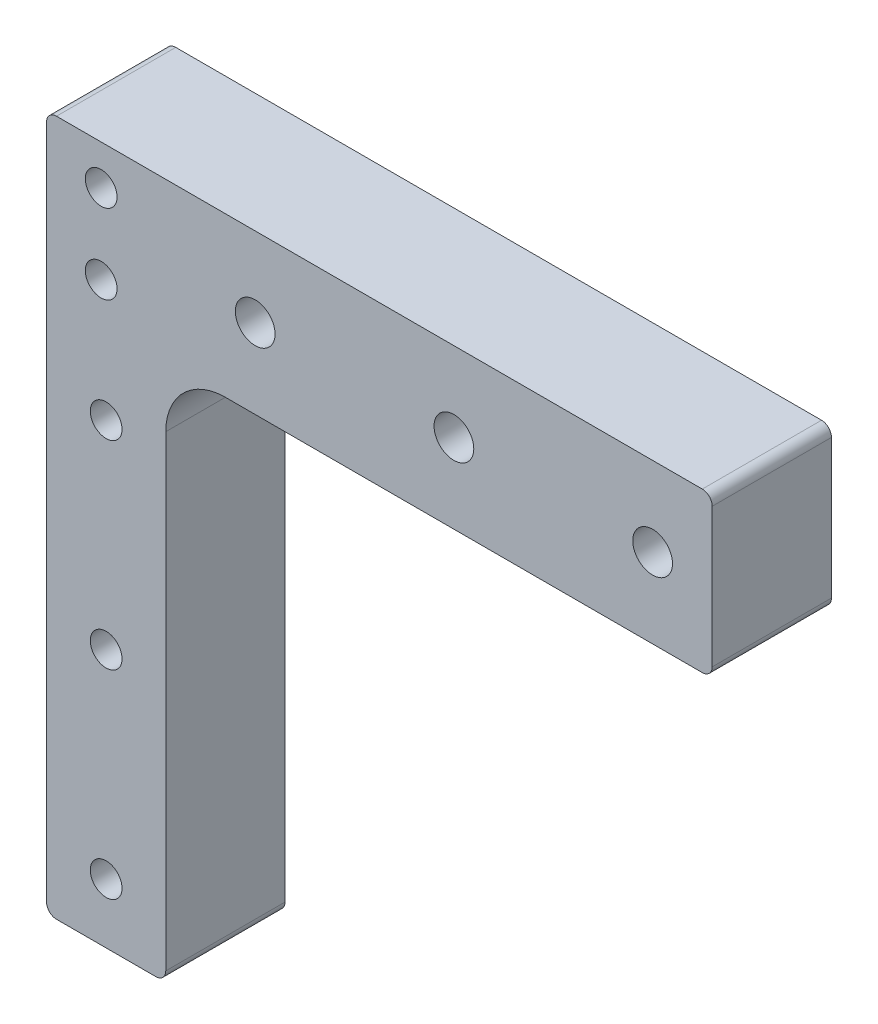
ISO-10303-21;
HEADER;
FILE_DESCRIPTION(('STEP AP214'),'2;1');
FILE_NAME('part.step','',(''),(''),'','','');
FILE_SCHEMA(('AUTOMOTIVE_DESIGN { 1 0 10303 214 1 1 1 1 }'));
ENDSEC;
DATA;
#1=APPLICATION_CONTEXT('core data for automotive mechanical design processes');
#2=APPLICATION_PROTOCOL_DEFINITION('international standard','automotive_design',2000,#1);
#3=PRODUCT_CONTEXT('',#1,'mechanical');
#4=PRODUCT('Part','Part','',(#3));
#5=PRODUCT_RELATED_PRODUCT_CATEGORY('part','',(#4));
#6=PRODUCT_DEFINITION_FORMATION('','',#4);
#7=PRODUCT_DEFINITION_CONTEXT('part definition',#1,'design');
#8=PRODUCT_DEFINITION('design','',#6,#7);
#9=PRODUCT_DEFINITION_SHAPE('','',#8);
#10=(LENGTH_UNIT() NAMED_UNIT(*) SI_UNIT(.MILLI.,.METRE.));
#11=(NAMED_UNIT(*) PLANE_ANGLE_UNIT() SI_UNIT($,.RADIAN.));
#12=(NAMED_UNIT(*) SI_UNIT($,.STERADIAN.) SOLID_ANGLE_UNIT());
#13=UNCERTAINTY_MEASURE_WITH_UNIT(LENGTH_MEASURE(1.E-05),#10,'distance_accuracy_value','');
#14=(GEOMETRIC_REPRESENTATION_CONTEXT(3) GLOBAL_UNCERTAINTY_ASSIGNED_CONTEXT((#13)) GLOBAL_UNIT_ASSIGNED_CONTEXT((#10,
#11,#12)) REPRESENTATION_CONTEXT('',''));
#15=CARTESIAN_POINT('',(0.,0.,0.));
#16=DIRECTION('',(0.,0.,1.));
#17=DIRECTION('',(1.,0.,0.));
#18=AXIS2_PLACEMENT_3D('',#15,#16,#17);
#19=CARTESIAN_POINT('',(0.,0.,12.));
#20=DIRECTION('',(0.,0.,-1.));
#21=DIRECTION('',(-1.,0.,0.));
#22=AXIS2_PLACEMENT_3D('',#19,#20,#21);
#23=CYLINDRICAL_SURFACE('',#22,1.6);
#24=CARTESIAN_POINT('',(0.,0.,7.));
#25=DIRECTION('',(0.,0.,1.));
#26=DIRECTION('',(1.,0.,0.));
#27=AXIS2_PLACEMENT_3D('',#24,#25,#26);
#28=CIRCLE('',#27,1.6);
#29=CARTESIAN_POINT('',(1.6,0.,7.));
#30=VERTEX_POINT('',#29);
#31=EDGE_CURVE('E217',#30,#30,#28,.T.);
#32=ORIENTED_EDGE('',*,*,#31,.T.);
#33=EDGE_LOOP('',(#32));
#34=FACE_BOUND('',#33,.T.);
#35=CARTESIAN_POINT('',(0.,0.,5.));
#36=DIRECTION('',(0.,0.,-1.));
#37=DIRECTION('',(-1.,0.,0.));
#38=AXIS2_PLACEMENT_3D('',#35,#36,#37);
#39=CIRCLE('',#38,1.6);
#40=CARTESIAN_POINT('',(-1.6,0.,5.));
#41=VERTEX_POINT('',#40);
#42=EDGE_CURVE('E45',#41,#41,#39,.T.);
#43=ORIENTED_EDGE('',*,*,#42,.T.);
#44=EDGE_LOOP('',(#43));
#45=FACE_BOUND('',#44,.T.);
#46=ADVANCED_FACE('F41',(#34,#45),#23,.F.);
#47=CARTESIAN_POINT('',(20.,0.,12.));
#48=DIRECTION('',(0.,0.,-1.));
#49=DIRECTION('',(-1.,0.,0.));
#50=AXIS2_PLACEMENT_3D('',#47,#48,#49);
#51=CYLINDRICAL_SURFACE('',#50,1.6);
#52=CARTESIAN_POINT('',(20.,0.,7.));
#53=DIRECTION('',(0.,0.,1.));
#54=DIRECTION('',(1.,0.,0.));
#55=AXIS2_PLACEMENT_3D('',#52,#53,#54);
#56=CIRCLE('',#55,1.6);
#57=CARTESIAN_POINT('',(21.6,0.,7.));
#58=VERTEX_POINT('',#57);
#59=EDGE_CURVE('E213',#58,#58,#56,.T.);
#60=ORIENTED_EDGE('',*,*,#59,.T.);
#61=EDGE_LOOP('',(#60));
#62=FACE_BOUND('',#61,.T.);
#63=CARTESIAN_POINT('',(20.,0.,5.));
#64=DIRECTION('',(0.,0.,-1.));
#65=DIRECTION('',(-1.,0.,0.));
#66=AXIS2_PLACEMENT_3D('',#63,#64,#65);
#67=CIRCLE('',#66,1.6);
#68=CARTESIAN_POINT('',(18.4,0.,5.));
#69=VERTEX_POINT('',#68);
#70=EDGE_CURVE('E223',#69,#69,#67,.T.);
#71=ORIENTED_EDGE('',*,*,#70,.T.);
#72=EDGE_LOOP('',(#71));
#73=FACE_BOUND('',#72,.T.);
#74=ADVANCED_FACE('F335',(#62,#73),#51,.F.);
#75=CARTESIAN_POINT('',(40.,0.,12.));
#76=DIRECTION('',(0.,0.,-1.));
#77=DIRECTION('',(-1.,0.,0.));
#78=AXIS2_PLACEMENT_3D('',#75,#76,#77);
#79=CYLINDRICAL_SURFACE('',#78,1.6);
#80=CARTESIAN_POINT('',(40.,0.,7.));
#81=DIRECTION('',(0.,0.,1.));
#82=DIRECTION('',(1.,0.,0.));
#83=AXIS2_PLACEMENT_3D('',#80,#81,#82);
#84=CIRCLE('',#83,1.6);
#85=CARTESIAN_POINT('',(41.6,0.,7.));
#86=VERTEX_POINT('',#85);
#87=EDGE_CURVE('E210',#86,#86,#84,.T.);
#88=ORIENTED_EDGE('',*,*,#87,.T.);
#89=EDGE_LOOP('',(#88));
#90=FACE_BOUND('',#89,.T.);
#91=CARTESIAN_POINT('',(40.,0.,5.));
#92=DIRECTION('',(0.,0.,-1.));
#93=DIRECTION('',(-1.,0.,0.));
#94=AXIS2_PLACEMENT_3D('',#91,#92,#93);
#95=CIRCLE('',#94,1.6);
#96=CARTESIAN_POINT('',(38.4,0.,5.));
#97=VERTEX_POINT('',#96);
#98=EDGE_CURVE('E221',#97,#97,#95,.T.);
#99=ORIENTED_EDGE('',*,*,#98,.T.);
#100=EDGE_LOOP('',(#99));
#101=FACE_BOUND('',#100,.T.);
#102=ADVANCED_FACE('F342',(#90,#101),#79,.F.);
#103=CARTESIAN_POINT('',(0.,0.,12.));
#104=DIRECTION('',(0.,0.,1.));
#105=DIRECTION('',(1.,0.,0.));
#106=AXIS2_PLACEMENT_3D('',#103,#104,#105);
#107=PLANE('',#106);
#108=CARTESIAN_POINT('',(0.,0.,12.));
#109=DIRECTION('',(0.,0.,1.));
#110=DIRECTION('',(1.,0.,0.));
#111=AXIS2_PLACEMENT_3D('',#108,#109,#110);
#112=CIRCLE('',#111,2.);
#113=CARTESIAN_POINT('',(2.,0.,12.));
#114=VERTEX_POINT('',#113);
#115=EDGE_CURVE('E683',#114,#114,#112,.T.);
#116=ORIENTED_EDGE('',*,*,#115,.F.);
#117=EDGE_LOOP('',(#116));
#118=FACE_BOUND('',#117,.T.);
#119=CARTESIAN_POINT('',(20.,0.,12.));
#120=DIRECTION('',(0.,0.,1.));
#121=DIRECTION('',(1.,0.,0.));
#122=AXIS2_PLACEMENT_3D('',#119,#120,#121);
#123=CIRCLE('',#122,2.);
#124=CARTESIAN_POINT('',(22.,0.,12.));
#125=VERTEX_POINT('',#124);
#126=EDGE_CURVE('E686',#125,#125,#123,.T.);
#127=ORIENTED_EDGE('',*,*,#126,.F.);
#128=EDGE_LOOP('',(#127));
#129=FACE_BOUND('',#128,.T.);
#130=CARTESIAN_POINT('',(40.,0.,12.));
#131=DIRECTION('',(0.,0.,1.));
#132=DIRECTION('',(1.,0.,0.));
#133=AXIS2_PLACEMENT_3D('',#130,#131,#132);
#134=CIRCLE('',#133,2.);
#135=CARTESIAN_POINT('',(42.,0.,12.));
#136=VERTEX_POINT('',#135);
#137=EDGE_CURVE('E233',#136,#136,#134,.T.);
#138=ORIENTED_EDGE('',*,*,#137,.F.);
#139=EDGE_LOOP('',(#138));
#140=FACE_BOUND('',#139,.T.);
#141=CARTESIAN_POINT('',(-15.0000000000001,-36.,12.));
#142=DIRECTION('',(0.,0.,1.));
#143=DIRECTION('',(1.,0.,0.));
#144=AXIS2_PLACEMENT_3D('',#141,#142,#143);
#145=CIRCLE('',#144,1.6);
#146=CARTESIAN_POINT('',(-13.4000000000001,-36.,12.));
#147=VERTEX_POINT('',#146);
#148=EDGE_CURVE('E248',#147,#147,#145,.T.);
#149=ORIENTED_EDGE('',*,*,#148,.F.);
#150=EDGE_LOOP('',(#149));
#151=FACE_BOUND('',#150,.T.);
#152=CARTESIAN_POINT('',(-15.5,-4.00000000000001,12.));
#153=DIRECTION('',(0.,0.,1.));
#154=DIRECTION('',(1.,0.,0.));
#155=AXIS2_PLACEMENT_3D('',#152,#153,#154);
#156=CIRCLE('',#155,1.6);
#157=CARTESIAN_POINT('',(-13.9,-4.00000000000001,12.));
#158=VERTEX_POINT('',#157);
#159=EDGE_CURVE('E260',#158,#158,#156,.T.);
#160=ORIENTED_EDGE('',*,*,#159,.F.);
#161=EDGE_LOOP('',(#160));
#162=FACE_BOUND('',#161,.T.);
#163=DIRECTION('',(1.,0.,0.));
#164=VECTOR('',#163,1.);
#165=CARTESIAN_POINT('',(-9.,-8.,12.));
#166=LINE('',#165,#164);
#167=CARTESIAN_POINT('',(-3.,-8.,12.));
#168=VERTEX_POINT('',#167);
#169=CARTESIAN_POINT('',(45.,-8.,12.));
#170=VERTEX_POINT('',#169);
#171=EDGE_CURVE('E154',#168,#170,#166,.T.);
#172=ORIENTED_EDGE('',*,*,#171,.T.);
#173=CARTESIAN_POINT('',(45.,-7.,12.));
#174=DIRECTION('',(0.,0.,1.));
#175=DIRECTION('',(1.,0.,0.));
#176=AXIS2_PLACEMENT_3D('',#173,#174,#175);
#177=CIRCLE('',#176,1.);
#178=CARTESIAN_POINT('',(46.,-7.,12.));
#179=VERTEX_POINT('',#178);
#180=EDGE_CURVE('E195',#170,#179,#177,.T.);
#181=ORIENTED_EDGE('',*,*,#180,.T.);
#182=DIRECTION('',(0.,1.,0.));
#183=VECTOR('',#182,1.);
#184=CARTESIAN_POINT('',(46.,8.,12.));
#185=LINE('',#184,#183);
#186=CARTESIAN_POINT('',(46.,7.,12.));
#187=VERTEX_POINT('',#186);
#188=EDGE_CURVE('E160',#179,#187,#185,.T.);
#189=ORIENTED_EDGE('',*,*,#188,.T.);
#190=CARTESIAN_POINT('',(45.,7.,12.));
#191=DIRECTION('',(0.,0.,1.));
#192=DIRECTION('',(1.,0.,0.));
#193=AXIS2_PLACEMENT_3D('',#190,#191,#192);
#194=CIRCLE('',#193,1.);
#195=CARTESIAN_POINT('',(45.,8.,12.));
#196=VERTEX_POINT('',#195);
#197=EDGE_CURVE('E193',#187,#196,#194,.T.);
#198=ORIENTED_EDGE('',*,*,#197,.T.);
#199=DIRECTION('',(-1.,0.,0.));
#200=VECTOR('',#199,1.);
#201=CARTESIAN_POINT('',(46.,8.,12.));
#202=LINE('',#201,#200);
#203=CARTESIAN_POINT('',(-20.,7.99999999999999,12.));
#204=VERTEX_POINT('',#203);
#205=EDGE_CURVE('E164',#196,#204,#202,.T.);
#206=ORIENTED_EDGE('',*,*,#205,.T.);
#207=CARTESIAN_POINT('',(-20.,6.99999999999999,12.));
#208=DIRECTION('',(0.,0.,1.));
#209=DIRECTION('',(1.,0.,0.));
#210=AXIS2_PLACEMENT_3D('',#207,#208,#209);
#211=CIRCLE('',#210,1.);
#212=CARTESIAN_POINT('',(-21.,6.99999999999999,12.));
#213=VERTEX_POINT('',#212);
#214=EDGE_CURVE('E188',#204,#213,#211,.T.);
#215=ORIENTED_EDGE('',*,*,#214,.T.);
#216=DIRECTION('',(0.,-1.,0.));
#217=VECTOR('',#216,1.);
#218=CARTESIAN_POINT('',(-21.,7.99999999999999,12.));
#219=LINE('',#218,#217);
#220=CARTESIAN_POINT('',(-21.,-61.,12.));
#221=VERTEX_POINT('',#220);
#222=EDGE_CURVE('E274',#213,#221,#219,.T.);
#223=ORIENTED_EDGE('',*,*,#222,.T.);
#224=CARTESIAN_POINT('',(-20.,-61.,12.));
#225=DIRECTION('',(0.,0.,1.));
#226=DIRECTION('',(1.,0.,0.));
#227=AXIS2_PLACEMENT_3D('',#224,#225,#226);
#228=CIRCLE('',#227,1.);
#229=CARTESIAN_POINT('',(-20.,-62.,12.));
#230=VERTEX_POINT('',#229);
#231=EDGE_CURVE('E191',#221,#230,#228,.T.);
#232=ORIENTED_EDGE('',*,*,#231,.T.);
#233=DIRECTION('',(1.,0.,0.));
#234=VECTOR('',#233,1.);
#235=CARTESIAN_POINT('',(-21.,-62.,12.));
#236=LINE('',#235,#234);
#237=CARTESIAN_POINT('',(-10.,-62.,12.));
#238=VERTEX_POINT('',#237);
#239=EDGE_CURVE('E277',#230,#238,#236,.T.);
#240=ORIENTED_EDGE('',*,*,#239,.T.);
#241=CARTESIAN_POINT('',(-10.,-61.,12.));
#242=DIRECTION('',(0.,0.,1.));
#243=DIRECTION('',(1.,0.,0.));
#244=AXIS2_PLACEMENT_3D('',#241,#242,#243);
#245=CIRCLE('',#244,1.);
#246=CARTESIAN_POINT('',(-9.,-61.,12.));
#247=VERTEX_POINT('',#246);
#248=EDGE_CURVE('E58',#238,#247,#245,.T.);
#249=ORIENTED_EDGE('',*,*,#248,.T.);
#250=DIRECTION('',(0.,1.,0.));
#251=VECTOR('',#250,1.);
#252=CARTESIAN_POINT('',(-9.,-62.,12.));
#253=LINE('',#252,#251);
#254=CARTESIAN_POINT('',(-9.,-14.,12.));
#255=VERTEX_POINT('',#254);
#256=EDGE_CURVE('E279',#247,#255,#253,.T.);
#257=ORIENTED_EDGE('',*,*,#256,.T.);
#258=CARTESIAN_POINT('',(-3.,-14.,12.));
#259=DIRECTION('',(0.,0.,1.));
#260=DIRECTION('',(1.,0.,0.));
#261=AXIS2_PLACEMENT_3D('',#258,#259,#260);
#262=CIRCLE('',#261,6.);
#263=EDGE_CURVE('E145',#255,#168,#262,.F.);
#264=ORIENTED_EDGE('',*,*,#263,.T.);
#265=EDGE_LOOP('',(#172,#181,#189,#198,#206,#215,#223,#232,#240,#249,#257,#264));
#266=FACE_BOUND('',#265,.T.);
#267=CARTESIAN_POINT('',(-15.5,3.99999999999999,12.));
#268=DIRECTION('',(0.,0.,1.));
#269=DIRECTION('',(1.,0.,0.));
#270=AXIS2_PLACEMENT_3D('',#267,#268,#269);
#271=CIRCLE('',#270,1.6);
#272=CARTESIAN_POINT('',(-13.9,3.99999999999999,12.));
#273=VERTEX_POINT('',#272);
#274=EDGE_CURVE('E266',#273,#273,#271,.T.);
#275=ORIENTED_EDGE('',*,*,#274,.F.);
#276=EDGE_LOOP('',(#275));
#277=FACE_BOUND('',#276,.T.);
#278=CARTESIAN_POINT('',(-15.,-56.,12.));
#279=DIRECTION('',(0.,0.,1.));
#280=DIRECTION('',(1.,0.,0.));
#281=AXIS2_PLACEMENT_3D('',#278,#279,#280);
#282=CIRCLE('',#281,1.6);
#283=CARTESIAN_POINT('',(-13.4,-56.,12.));
#284=VERTEX_POINT('',#283);
#285=EDGE_CURVE('E254',#284,#284,#282,.T.);
#286=ORIENTED_EDGE('',*,*,#285,.F.);
#287=EDGE_LOOP('',(#286));
#288=FACE_BOUND('',#287,.T.);
#289=CARTESIAN_POINT('',(-15.0000000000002,-16.,12.));
#290=DIRECTION('',(0.,0.,1.));
#291=DIRECTION('',(1.,0.,0.));
#292=AXIS2_PLACEMENT_3D('',#289,#290,#291);
#293=CIRCLE('',#292,1.6);
#294=CARTESIAN_POINT('',(-13.4000000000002,-16.,12.));
#295=VERTEX_POINT('',#294);
#296=EDGE_CURVE('E242',#295,#295,#293,.T.);
#297=ORIENTED_EDGE('',*,*,#296,.F.);
#298=EDGE_LOOP('',(#297));
#299=FACE_BOUND('',#298,.T.);
#300=ADVANCED_FACE('F297',(#118,#129,#140,#151,#162,#266,#277,#288,#299),#107,.T.);
#301=CARTESIAN_POINT('',(0.,0.,0.));
#302=DIRECTION('',(0.,0.,1.));
#303=DIRECTION('',(1.,0.,0.));
#304=AXIS2_PLACEMENT_3D('',#301,#302,#303);
#305=PLANE('',#304);
#306=CARTESIAN_POINT('',(0.,0.,0.));
#307=DIRECTION('',(0.,0.,-1.));
#308=DIRECTION('',(-1.,0.,0.));
#309=AXIS2_PLACEMENT_3D('',#306,#307,#308);
#310=CIRCLE('',#309,2.);
#311=CARTESIAN_POINT('',(-2.,0.,0.));
#312=VERTEX_POINT('',#311);
#313=EDGE_CURVE('E664',#312,#312,#310,.T.);
#314=ORIENTED_EDGE('',*,*,#313,.F.);
#315=EDGE_LOOP('',(#314));
#316=FACE_BOUND('',#315,.T.);
#317=CARTESIAN_POINT('',(20.,-1.39659253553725E-13,0.));
#318=DIRECTION('',(0.,0.,-1.));
#319=DIRECTION('',(-1.,0.,0.));
#320=AXIS2_PLACEMENT_3D('',#317,#318,#319);
#321=CIRCLE('',#320,2.);
#322=CARTESIAN_POINT('',(18.,-1.39659253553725E-13,0.));
#323=VERTEX_POINT('',#322);
#324=EDGE_CURVE('E667',#323,#323,#321,.T.);
#325=ORIENTED_EDGE('',*,*,#324,.F.);
#326=EDGE_LOOP('',(#325));
#327=FACE_BOUND('',#326,.T.);
#328=CARTESIAN_POINT('',(40.,-2.79318507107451E-13,0.));
#329=DIRECTION('',(0.,0.,-1.));
#330=DIRECTION('',(-1.,0.,0.));
#331=AXIS2_PLACEMENT_3D('',#328,#329,#330);
#332=CIRCLE('',#331,2.);
#333=CARTESIAN_POINT('',(38.,-2.79318507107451E-13,0.));
#334=VERTEX_POINT('',#333);
#335=EDGE_CURVE('E675',#334,#334,#332,.T.);
#336=ORIENTED_EDGE('',*,*,#335,.F.);
#337=EDGE_LOOP('',(#336));
#338=FACE_BOUND('',#337,.T.);
#339=DIRECTION('',(0.,1.,0.));
#340=VECTOR('',#339,1.);
#341=CARTESIAN_POINT('',(46.,8.,0.));
#342=LINE('',#341,#340);
#343=CARTESIAN_POINT('',(46.,-7.,0.));
#344=VERTEX_POINT('',#343);
#345=CARTESIAN_POINT('',(46.,7.,0.));
#346=VERTEX_POINT('',#345);
#347=EDGE_CURVE('E269',#344,#346,#342,.T.);
#348=ORIENTED_EDGE('',*,*,#347,.F.);
#349=CARTESIAN_POINT('',(45.,-7.,0.));
#350=DIRECTION('',(0.,0.,1.));
#351=DIRECTION('',(1.,0.,0.));
#352=AXIS2_PLACEMENT_3D('',#349,#350,#351);
#353=CIRCLE('',#352,1.);
#354=CARTESIAN_POINT('',(45.,-8.,0.));
#355=VERTEX_POINT('',#354);
#356=EDGE_CURVE('E159',#344,#355,#353,.F.);
#357=ORIENTED_EDGE('',*,*,#356,.T.);
#358=DIRECTION('',(1.,0.,0.));
#359=VECTOR('',#358,1.);
#360=CARTESIAN_POINT('',(-9.,-8.,0.));
#361=LINE('',#360,#359);
#362=CARTESIAN_POINT('',(-3.,-8.,0.));
#363=VERTEX_POINT('',#362);
#364=EDGE_CURVE('E151',#363,#355,#361,.T.);
#365=ORIENTED_EDGE('',*,*,#364,.F.);
#366=CARTESIAN_POINT('',(-3.,-14.,0.));
#367=DIRECTION('',(0.,0.,1.));
#368=DIRECTION('',(1.,0.,0.));
#369=AXIS2_PLACEMENT_3D('',#366,#367,#368);
#370=CIRCLE('',#369,6.);
#371=CARTESIAN_POINT('',(-9.,-14.,0.));
#372=VERTEX_POINT('',#371);
#373=EDGE_CURVE('E135',#363,#372,#370,.T.);
#374=ORIENTED_EDGE('',*,*,#373,.T.);
#375=DIRECTION('',(0.,1.,0.));
#376=VECTOR('',#375,1.);
#377=CARTESIAN_POINT('',(-9.,-62.,0.));
#378=LINE('',#377,#376);
#379=CARTESIAN_POINT('',(-9.,-61.,0.));
#380=VERTEX_POINT('',#379);
#381=EDGE_CURVE('E161',#380,#372,#378,.T.);
#382=ORIENTED_EDGE('',*,*,#381,.F.);
#383=CARTESIAN_POINT('',(-10.,-61.,0.));
#384=DIRECTION('',(0.,0.,1.));
#385=DIRECTION('',(1.,0.,0.));
#386=AXIS2_PLACEMENT_3D('',#383,#384,#385);
#387=CIRCLE('',#386,1.);
#388=CARTESIAN_POINT('',(-10.,-62.,0.));
#389=VERTEX_POINT('',#388);
#390=EDGE_CURVE('E179',#380,#389,#387,.F.);
#391=ORIENTED_EDGE('',*,*,#390,.T.);
#392=DIRECTION('',(1.,0.,0.));
#393=VECTOR('',#392,1.);
#394=CARTESIAN_POINT('',(-21.,-62.,0.));
#395=LINE('',#394,#393);
#396=CARTESIAN_POINT('',(-20.,-62.,0.));
#397=VERTEX_POINT('',#396);
#398=EDGE_CURVE('E166',#397,#389,#395,.T.);
#399=ORIENTED_EDGE('',*,*,#398,.F.);
#400=CARTESIAN_POINT('',(-20.,-61.,0.));
#401=DIRECTION('',(0.,0.,1.));
#402=DIRECTION('',(1.,0.,0.));
#403=AXIS2_PLACEMENT_3D('',#400,#401,#402);
#404=CIRCLE('',#403,1.);
#405=CARTESIAN_POINT('',(-21.,-61.,0.));
#406=VERTEX_POINT('',#405);
#407=EDGE_CURVE('E181',#397,#406,#404,.F.);
#408=ORIENTED_EDGE('',*,*,#407,.T.);
#409=DIRECTION('',(0.,-1.,0.));
#410=VECTOR('',#409,1.);
#411=CARTESIAN_POINT('',(-21.,7.99999999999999,0.));
#412=LINE('',#411,#410);
#413=CARTESIAN_POINT('',(-21.,6.99999999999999,0.));
#414=VERTEX_POINT('',#413);
#415=EDGE_CURVE('E287',#414,#406,#412,.T.);
#416=ORIENTED_EDGE('',*,*,#415,.F.);
#417=CARTESIAN_POINT('',(-20.,6.99999999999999,0.));
#418=DIRECTION('',(0.,0.,1.));
#419=DIRECTION('',(1.,0.,0.));
#420=AXIS2_PLACEMENT_3D('',#417,#418,#419);
#421=CIRCLE('',#420,1.);
#422=CARTESIAN_POINT('',(-20.,7.99999999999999,0.));
#423=VERTEX_POINT('',#422);
#424=EDGE_CURVE('E177',#414,#423,#421,.F.);
#425=ORIENTED_EDGE('',*,*,#424,.T.);
#426=DIRECTION('',(-1.,0.,0.));
#427=VECTOR('',#426,1.);
#428=CARTESIAN_POINT('',(46.,8.,0.));
#429=LINE('',#428,#427);
#430=CARTESIAN_POINT('',(45.,8.,0.));
#431=VERTEX_POINT('',#430);
#432=EDGE_CURVE('E284',#431,#423,#429,.T.);
#433=ORIENTED_EDGE('',*,*,#432,.F.);
#434=CARTESIAN_POINT('',(45.,7.,0.));
#435=DIRECTION('',(0.,0.,1.));
#436=DIRECTION('',(1.,0.,0.));
#437=AXIS2_PLACEMENT_3D('',#434,#435,#436);
#438=CIRCLE('',#437,1.);
#439=EDGE_CURVE('E183',#431,#346,#438,.F.);
#440=ORIENTED_EDGE('',*,*,#439,.T.);
#441=EDGE_LOOP('',(#348,#357,#365,#374,#382,#391,#399,#408,#416,#425,#433,#440));
#442=FACE_BOUND('',#441,.T.);
#443=CARTESIAN_POINT('',(-15.5,3.99999999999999,0.));
#444=DIRECTION('',(0.,0.,1.));
#445=DIRECTION('',(1.,0.,0.));
#446=AXIS2_PLACEMENT_3D('',#443,#444,#445);
#447=CIRCLE('',#446,1.6);
#448=CARTESIAN_POINT('',(-13.9,3.99999999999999,0.));
#449=VERTEX_POINT('',#448);
#450=EDGE_CURVE('E263',#449,#449,#447,.T.);
#451=ORIENTED_EDGE('',*,*,#450,.T.);
#452=EDGE_LOOP('',(#451));
#453=FACE_BOUND('',#452,.T.);
#454=CARTESIAN_POINT('',(-15.5,-4.00000000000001,0.));
#455=DIRECTION('',(0.,0.,1.));
#456=DIRECTION('',(1.,0.,0.));
#457=AXIS2_PLACEMENT_3D('',#454,#455,#456);
#458=CIRCLE('',#457,1.6);
#459=CARTESIAN_POINT('',(-13.9,-4.00000000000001,0.));
#460=VERTEX_POINT('',#459);
#461=EDGE_CURVE('E257',#460,#460,#458,.T.);
#462=ORIENTED_EDGE('',*,*,#461,.T.);
#463=EDGE_LOOP('',(#462));
#464=FACE_BOUND('',#463,.T.);
#465=CARTESIAN_POINT('',(-15.,-56.,0.));
#466=DIRECTION('',(0.,0.,1.));
#467=DIRECTION('',(1.,0.,0.));
#468=AXIS2_PLACEMENT_3D('',#465,#466,#467);
#469=CIRCLE('',#468,1.6);
#470=CARTESIAN_POINT('',(-13.4,-56.,0.));
#471=VERTEX_POINT('',#470);
#472=EDGE_CURVE('E251',#471,#471,#469,.T.);
#473=ORIENTED_EDGE('',*,*,#472,.T.);
#474=EDGE_LOOP('',(#473));
#475=FACE_BOUND('',#474,.T.);
#476=CARTESIAN_POINT('',(-15.0000000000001,-36.,0.));
#477=DIRECTION('',(0.,0.,1.));
#478=DIRECTION('',(1.,0.,0.));
#479=AXIS2_PLACEMENT_3D('',#476,#477,#478);
#480=CIRCLE('',#479,1.6);
#481=CARTESIAN_POINT('',(-13.4000000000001,-36.,0.));
#482=VERTEX_POINT('',#481);
#483=EDGE_CURVE('E245',#482,#482,#480,.T.);
#484=ORIENTED_EDGE('',*,*,#483,.T.);
#485=EDGE_LOOP('',(#484));
#486=FACE_BOUND('',#485,.T.);
#487=CARTESIAN_POINT('',(-15.0000000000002,-16.,0.));
#488=DIRECTION('',(0.,0.,1.));
#489=DIRECTION('',(1.,0.,0.));
#490=AXIS2_PLACEMENT_3D('',#487,#488,#489);
#491=CIRCLE('',#490,1.6);
#492=CARTESIAN_POINT('',(-13.4000000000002,-16.,0.));
#493=VERTEX_POINT('',#492);
#494=EDGE_CURVE('E220',#493,#493,#491,.T.);
#495=ORIENTED_EDGE('',*,*,#494,.T.);
#496=EDGE_LOOP('',(#495));
#497=FACE_BOUND('',#496,.T.);
#498=ADVANCED_FACE('F157',(#316,#327,#338,#442,#453,#464,#475,#486,#497),#305,.F.);
#499=CARTESIAN_POINT('',(46.,8.,12.));
#500=DIRECTION('',(-1.,0.,0.));
#501=DIRECTION('',(0.,0.,1.));
#502=AXIS2_PLACEMENT_3D('',#499,#500,#501);
#503=PLANE('',#502);
#504=ORIENTED_EDGE('',*,*,#188,.F.);
#505=DIRECTION('',(0.,0.,-1.));
#506=VECTOR('',#505,1.);
#507=CARTESIAN_POINT('',(46.,-7.,12.));
#508=LINE('',#507,#506);
#509=EDGE_CURVE('E174',#179,#344,#508,.T.);
#510=ORIENTED_EDGE('',*,*,#509,.T.);
#511=ORIENTED_EDGE('',*,*,#347,.T.);
#512=DIRECTION('',(0.,0.,-1.));
#513=VECTOR('',#512,1.);
#514=CARTESIAN_POINT('',(46.,7.,12.));
#515=LINE('',#514,#513);
#516=EDGE_CURVE('E172',#346,#187,#515,.F.);
#517=ORIENTED_EDGE('',*,*,#516,.T.);
#518=EDGE_LOOP('',(#504,#510,#511,#517));
#519=FACE_BOUND('',#518,.T.);
#520=ADVANCED_FACE('F305',(#519),#503,.F.);
#521=CARTESIAN_POINT('',(46.,8.,12.));
#522=DIRECTION('',(0.,-1.,0.));
#523=DIRECTION('',(1.,0.,0.));
#524=AXIS2_PLACEMENT_3D('',#521,#522,#523);
#525=PLANE('',#524);
#526=ORIENTED_EDGE('',*,*,#205,.F.);
#527=DIRECTION('',(0.,0.,-1.));
#528=VECTOR('',#527,1.);
#529=CARTESIAN_POINT('',(45.,8.,12.));
#530=LINE('',#529,#528);
#531=EDGE_CURVE('E199',#196,#431,#530,.T.);
#532=ORIENTED_EDGE('',*,*,#531,.T.);
#533=ORIENTED_EDGE('',*,*,#432,.T.);
#534=DIRECTION('',(0.,0.,-1.));
#535=VECTOR('',#534,1.);
#536=CARTESIAN_POINT('',(-20.,7.99999999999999,12.));
#537=LINE('',#536,#535);
#538=EDGE_CURVE('E197',#423,#204,#537,.F.);
#539=ORIENTED_EDGE('',*,*,#538,.T.);
#540=EDGE_LOOP('',(#526,#532,#533,#539));
#541=FACE_BOUND('',#540,.T.);
#542=ADVANCED_FACE('F314',(#541),#525,.F.);
#543=CARTESIAN_POINT('',(-21.,7.99999999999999,12.));
#544=DIRECTION('',(1.,0.,0.));
#545=DIRECTION('',(0.,1.,0.));
#546=AXIS2_PLACEMENT_3D('',#543,#544,#545);
#547=PLANE('',#546);
#548=ORIENTED_EDGE('',*,*,#415,.T.);
#549=DIRECTION('',(0.,0.,-1.));
#550=VECTOR('',#549,1.);
#551=CARTESIAN_POINT('',(-21.,-61.,12.));
#552=LINE('',#551,#550);
#553=EDGE_CURVE('E50',#406,#221,#552,.F.);
#554=ORIENTED_EDGE('',*,*,#553,.T.);
#555=ORIENTED_EDGE('',*,*,#222,.F.);
#556=DIRECTION('',(0.,0.,-1.));
#557=VECTOR('',#556,1.);
#558=CARTESIAN_POINT('',(-21.,6.99999999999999,12.));
#559=LINE('',#558,#557);
#560=EDGE_CURVE('E206',#213,#414,#559,.T.);
#561=ORIENTED_EDGE('',*,*,#560,.T.);
#562=EDGE_LOOP('',(#548,#554,#555,#561));
#563=FACE_BOUND('',#562,.T.);
#564=ADVANCED_FACE('F322',(#563),#547,.F.);
#565=CARTESIAN_POINT('',(-21.,-62.,12.));
#566=DIRECTION('',(0.,1.,0.));
#567=DIRECTION('',(0.,0.,1.));
#568=AXIS2_PLACEMENT_3D('',#565,#566,#567);
#569=PLANE('',#568);
#570=ORIENTED_EDGE('',*,*,#239,.F.);
#571=DIRECTION('',(0.,0.,-1.));
#572=VECTOR('',#571,1.);
#573=CARTESIAN_POINT('',(-20.,-62.,12.));
#574=LINE('',#573,#572);
#575=EDGE_CURVE('E203',#230,#397,#574,.T.);
#576=ORIENTED_EDGE('',*,*,#575,.T.);
#577=ORIENTED_EDGE('',*,*,#398,.T.);
#578=DIRECTION('',(0.,0.,-1.));
#579=VECTOR('',#578,1.);
#580=CARTESIAN_POINT('',(-10.,-62.,12.));
#581=LINE('',#580,#579);
#582=EDGE_CURVE('E66',#389,#238,#581,.F.);
#583=ORIENTED_EDGE('',*,*,#582,.T.);
#584=EDGE_LOOP('',(#570,#576,#577,#583));
#585=FACE_BOUND('',#584,.T.);
#586=ADVANCED_FACE('F290',(#585),#569,.F.);
#587=CARTESIAN_POINT('',(-9.,-62.,12.));
#588=DIRECTION('',(-1.,0.,0.));
#589=DIRECTION('',(0.,0.,1.));
#590=AXIS2_PLACEMENT_3D('',#587,#588,#589);
#591=PLANE('',#590);
#592=ORIENTED_EDGE('',*,*,#256,.F.);
#593=DIRECTION('',(0.,0.,-1.));
#594=VECTOR('',#593,1.);
#595=CARTESIAN_POINT('',(-9.,-61.,12.));
#596=LINE('',#595,#594);
#597=EDGE_CURVE('E11',#247,#380,#596,.T.);
#598=ORIENTED_EDGE('',*,*,#597,.T.);
#599=ORIENTED_EDGE('',*,*,#381,.T.);
#600=DIRECTION('',(0.,0.,-1.));
#601=VECTOR('',#600,1.);
#602=CARTESIAN_POINT('',(-9.,-14.,12.));
#603=LINE('',#602,#601);
#604=EDGE_CURVE('E141',#372,#255,#603,.F.);
#605=ORIENTED_EDGE('',*,*,#604,.T.);
#606=EDGE_LOOP('',(#592,#598,#599,#605));
#607=FACE_BOUND('',#606,.T.);
#608=ADVANCED_FACE('F296',(#607),#591,.F.);
#609=CARTESIAN_POINT('',(-9.,-8.,12.));
#610=DIRECTION('',(0.,1.,0.));
#611=DIRECTION('',(0.,0.,1.));
#612=AXIS2_PLACEMENT_3D('',#609,#610,#611);
#613=PLANE('',#612);
#614=ORIENTED_EDGE('',*,*,#364,.T.);
#615=DIRECTION('',(0.,0.,-1.));
#616=VECTOR('',#615,1.);
#617=CARTESIAN_POINT('',(45.,-8.,12.));
#618=LINE('',#617,#616);
#619=EDGE_CURVE('E186',#355,#170,#618,.F.);
#620=ORIENTED_EDGE('',*,*,#619,.T.);
#621=ORIENTED_EDGE('',*,*,#171,.F.);
#622=DIRECTION('',(0.,0.,-1.));
#623=VECTOR('',#622,1.);
#624=CARTESIAN_POINT('',(-3.,-8.,0.));
#625=LINE('',#624,#623);
#626=EDGE_CURVE('E139',#168,#363,#625,.T.);
#627=ORIENTED_EDGE('',*,*,#626,.T.);
#628=EDGE_LOOP('',(#614,#620,#621,#627));
#629=FACE_BOUND('',#628,.T.);
#630=ADVANCED_FACE('F150',(#629),#613,.F.);
#631=CARTESIAN_POINT('',(-15.5,3.99999999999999,12.));
#632=DIRECTION('',(0.,0.,-1.));
#633=DIRECTION('',(-1.,0.,0.));
#634=AXIS2_PLACEMENT_3D('',#631,#632,#633);
#635=CYLINDRICAL_SURFACE('',#634,1.6);
#636=ORIENTED_EDGE('',*,*,#274,.T.);
#637=EDGE_LOOP('',(#636));
#638=FACE_BOUND('',#637,.T.);
#639=ORIENTED_EDGE('',*,*,#450,.F.);
#640=EDGE_LOOP('',(#639));
#641=FACE_BOUND('',#640,.T.);
#642=ADVANCED_FACE('F355',(#638,#641),#635,.F.);
#643=CARTESIAN_POINT('',(-15.5,-4.00000000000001,12.));
#644=DIRECTION('',(0.,0.,-1.));
#645=DIRECTION('',(-1.,0.,0.));
#646=AXIS2_PLACEMENT_3D('',#643,#644,#645);
#647=CYLINDRICAL_SURFACE('',#646,1.6);
#648=ORIENTED_EDGE('',*,*,#159,.T.);
#649=EDGE_LOOP('',(#648));
#650=FACE_BOUND('',#649,.T.);
#651=ORIENTED_EDGE('',*,*,#461,.F.);
#652=EDGE_LOOP('',(#651));
#653=FACE_BOUND('',#652,.T.);
#654=ADVANCED_FACE('F550',(#650,#653),#647,.F.);
#655=CARTESIAN_POINT('',(-15.,-56.,12.));
#656=DIRECTION('',(0.,0.,-1.));
#657=DIRECTION('',(-1.,0.,0.));
#658=AXIS2_PLACEMENT_3D('',#655,#656,#657);
#659=CYLINDRICAL_SURFACE('',#658,1.6);
#660=ORIENTED_EDGE('',*,*,#285,.T.);
#661=EDGE_LOOP('',(#660));
#662=FACE_BOUND('',#661,.T.);
#663=ORIENTED_EDGE('',*,*,#472,.F.);
#664=EDGE_LOOP('',(#663));
#665=FACE_BOUND('',#664,.T.);
#666=ADVANCED_FACE('F546',(#662,#665),#659,.F.);
#667=CARTESIAN_POINT('',(-15.0000000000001,-36.,12.));
#668=DIRECTION('',(0.,0.,-1.));
#669=DIRECTION('',(-1.,0.,0.));
#670=AXIS2_PLACEMENT_3D('',#667,#668,#669);
#671=CYLINDRICAL_SURFACE('',#670,1.6);
#672=ORIENTED_EDGE('',*,*,#148,.T.);
#673=EDGE_LOOP('',(#672));
#674=FACE_BOUND('',#673,.T.);
#675=ORIENTED_EDGE('',*,*,#483,.F.);
#676=EDGE_LOOP('',(#675));
#677=FACE_BOUND('',#676,.T.);
#678=ADVANCED_FACE('F542',(#674,#677),#671,.F.);
#679=CARTESIAN_POINT('',(-15.0000000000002,-16.,12.));
#680=DIRECTION('',(0.,0.,-1.));
#681=DIRECTION('',(-1.,0.,0.));
#682=AXIS2_PLACEMENT_3D('',#679,#680,#681);
#683=CYLINDRICAL_SURFACE('',#682,1.6);
#684=ORIENTED_EDGE('',*,*,#296,.T.);
#685=EDGE_LOOP('',(#684));
#686=FACE_BOUND('',#685,.T.);
#687=ORIENTED_EDGE('',*,*,#494,.F.);
#688=EDGE_LOOP('',(#687));
#689=FACE_BOUND('',#688,.T.);
#690=ADVANCED_FACE('F368',(#686,#689),#683,.F.);
#691=CARTESIAN_POINT('',(-3.,-14.,12.));
#692=DIRECTION('',(0.,0.,1.));
#693=DIRECTION('',(1.,0.,0.));
#694=AXIS2_PLACEMENT_3D('',#691,#692,#693);
#695=CYLINDRICAL_SURFACE('',#694,6.);
#696=ORIENTED_EDGE('',*,*,#263,.F.);
#697=ORIENTED_EDGE('',*,*,#604,.F.);
#698=ORIENTED_EDGE('',*,*,#373,.F.);
#699=ORIENTED_EDGE('',*,*,#626,.F.);
#700=EDGE_LOOP('',(#696,#697,#698,#699));
#701=FACE_BOUND('',#700,.T.);
#702=ADVANCED_FACE('F138',(#701),#695,.F.);
#703=CARTESIAN_POINT('',(45.,-7.,12.));
#704=DIRECTION('',(0.,0.,-1.));
#705=DIRECTION('',(-1.,0.,0.));
#706=AXIS2_PLACEMENT_3D('',#703,#704,#705);
#707=CYLINDRICAL_SURFACE('',#706,1.);
#708=ORIENTED_EDGE('',*,*,#180,.F.);
#709=ORIENTED_EDGE('',*,*,#619,.F.);
#710=ORIENTED_EDGE('',*,*,#356,.F.);
#711=ORIENTED_EDGE('',*,*,#509,.F.);
#712=EDGE_LOOP('',(#708,#709,#710,#711));
#713=FACE_BOUND('',#712,.T.);
#714=ADVANCED_FACE('F303',(#713),#707,.T.);
#715=CARTESIAN_POINT('',(45.,7.,12.));
#716=DIRECTION('',(0.,0.,-1.));
#717=DIRECTION('',(-1.,0.,0.));
#718=AXIS2_PLACEMENT_3D('',#715,#716,#717);
#719=CYLINDRICAL_SURFACE('',#718,1.);
#720=ORIENTED_EDGE('',*,*,#197,.F.);
#721=ORIENTED_EDGE('',*,*,#516,.F.);
#722=ORIENTED_EDGE('',*,*,#439,.F.);
#723=ORIENTED_EDGE('',*,*,#531,.F.);
#724=EDGE_LOOP('',(#720,#721,#722,#723));
#725=FACE_BOUND('',#724,.T.);
#726=ADVANCED_FACE('F311',(#725),#719,.T.);
#727=CARTESIAN_POINT('',(-20.,-61.,12.));
#728=DIRECTION('',(0.,0.,-1.));
#729=DIRECTION('',(-1.,0.,0.));
#730=AXIS2_PLACEMENT_3D('',#727,#728,#729);
#731=CYLINDRICAL_SURFACE('',#730,1.);
#732=ORIENTED_EDGE('',*,*,#231,.F.);
#733=ORIENTED_EDGE('',*,*,#553,.F.);
#734=ORIENTED_EDGE('',*,*,#407,.F.);
#735=ORIENTED_EDGE('',*,*,#575,.F.);
#736=EDGE_LOOP('',(#732,#733,#734,#735));
#737=FACE_BOUND('',#736,.T.);
#738=ADVANCED_FACE('F326',(#737),#731,.T.);
#739=CARTESIAN_POINT('',(-10.,-61.,12.));
#740=DIRECTION('',(0.,0.,-1.));
#741=DIRECTION('',(-1.,0.,0.));
#742=AXIS2_PLACEMENT_3D('',#739,#740,#741);
#743=CYLINDRICAL_SURFACE('',#742,1.);
#744=ORIENTED_EDGE('',*,*,#248,.F.);
#745=ORIENTED_EDGE('',*,*,#582,.F.);
#746=ORIENTED_EDGE('',*,*,#390,.F.);
#747=ORIENTED_EDGE('',*,*,#597,.F.);
#748=EDGE_LOOP('',(#744,#745,#746,#747));
#749=FACE_BOUND('',#748,.T.);
#750=ADVANCED_FACE('F293',(#749),#743,.T.);
#751=CARTESIAN_POINT('',(-20.,6.99999999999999,12.));
#752=DIRECTION('',(0.,0.,-1.));
#753=DIRECTION('',(-1.,0.,0.));
#754=AXIS2_PLACEMENT_3D('',#751,#752,#753);
#755=CYLINDRICAL_SURFACE('',#754,1.);
#756=ORIENTED_EDGE('',*,*,#214,.F.);
#757=ORIENTED_EDGE('',*,*,#538,.F.);
#758=ORIENTED_EDGE('',*,*,#424,.F.);
#759=ORIENTED_EDGE('',*,*,#560,.F.);
#760=EDGE_LOOP('',(#756,#757,#758,#759));
#761=FACE_BOUND('',#760,.T.);
#762=ADVANCED_FACE('F43',(#761),#755,.T.);
#763=CARTESIAN_POINT('',(40.,0.,7.));
#764=DIRECTION('',(0.,0.,1.));
#765=DIRECTION('',(1.,0.,0.));
#766=AXIS2_PLACEMENT_3D('',#763,#764,#765);
#767=CYLINDRICAL_SURFACE('',#766,2.);
#768=CARTESIAN_POINT('',(40.,0.,7.));
#769=DIRECTION('',(0.,0.,1.));
#770=DIRECTION('',(1.,0.,0.));
#771=AXIS2_PLACEMENT_3D('',#768,#769,#770);
#772=CIRCLE('',#771,2.);
#773=CARTESIAN_POINT('',(42.,0.,7.));
#774=VERTEX_POINT('',#773);
#775=EDGE_CURVE('E229',#774,#774,#772,.T.);
#776=ORIENTED_EDGE('',*,*,#775,.F.);
#777=EDGE_LOOP('',(#776));
#778=FACE_BOUND('',#777,.T.);
#779=ORIENTED_EDGE('',*,*,#137,.T.);
#780=EDGE_LOOP('',(#779));
#781=FACE_BOUND('',#780,.T.);
#782=ADVANCED_FACE('F400',(#778,#781),#767,.F.);
#783=CARTESIAN_POINT('',(40.,0.,7.));
#784=DIRECTION('',(0.,0.,1.));
#785=DIRECTION('',(1.,0.,0.));
#786=AXIS2_PLACEMENT_3D('',#783,#784,#785);
#787=PLANE('',#786);
#788=ORIENTED_EDGE('',*,*,#87,.F.);
#789=EDGE_LOOP('',(#788));
#790=FACE_BOUND('',#789,.T.);
#791=ORIENTED_EDGE('',*,*,#775,.T.);
#792=EDGE_LOOP('',(#791));
#793=FACE_BOUND('',#792,.T.);
#794=ADVANCED_FACE('F408',(#790,#793),#787,.T.);
#795=CARTESIAN_POINT('',(20.,0.,7.));
#796=DIRECTION('',(0.,0.,1.));
#797=DIRECTION('',(1.,0.,0.));
#798=AXIS2_PLACEMENT_3D('',#795,#796,#797);
#799=CYLINDRICAL_SURFACE('',#798,2.);
#800=CARTESIAN_POINT('',(20.,0.,7.));
#801=DIRECTION('',(0.,0.,1.));
#802=DIRECTION('',(1.,0.,0.));
#803=AXIS2_PLACEMENT_3D('',#800,#801,#802);
#804=CIRCLE('',#803,2.);
#805=CARTESIAN_POINT('',(22.,0.,7.));
#806=VERTEX_POINT('',#805);
#807=EDGE_CURVE('E238',#806,#806,#804,.T.);
#808=ORIENTED_EDGE('',*,*,#807,.F.);
#809=EDGE_LOOP('',(#808));
#810=FACE_BOUND('',#809,.T.);
#811=ORIENTED_EDGE('',*,*,#126,.T.);
#812=EDGE_LOOP('',(#811));
#813=FACE_BOUND('',#812,.T.);
#814=ADVANCED_FACE('F418',(#810,#813),#799,.F.);
#815=CARTESIAN_POINT('',(20.,0.,7.));
#816=DIRECTION('',(0.,0.,1.));
#817=DIRECTION('',(1.,0.,0.));
#818=AXIS2_PLACEMENT_3D('',#815,#816,#817);
#819=PLANE('',#818);
#820=ORIENTED_EDGE('',*,*,#59,.F.);
#821=EDGE_LOOP('',(#820));
#822=FACE_BOUND('',#821,.T.);
#823=ORIENTED_EDGE('',*,*,#807,.T.);
#824=EDGE_LOOP('',(#823));
#825=FACE_BOUND('',#824,.T.);
#826=ADVANCED_FACE('F428',(#822,#825),#819,.T.);
#827=CARTESIAN_POINT('',(0.,0.,7.));
#828=DIRECTION('',(0.,0.,1.));
#829=DIRECTION('',(1.,0.,0.));
#830=AXIS2_PLACEMENT_3D('',#827,#828,#829);
#831=CYLINDRICAL_SURFACE('',#830,2.);
#832=CARTESIAN_POINT('',(0.,0.,7.));
#833=DIRECTION('',(0.,0.,1.));
#834=DIRECTION('',(1.,0.,0.));
#835=AXIS2_PLACEMENT_3D('',#832,#833,#834);
#836=CIRCLE('',#835,2.);
#837=CARTESIAN_POINT('',(2.,0.,7.));
#838=VERTEX_POINT('',#837);
#839=EDGE_CURVE('E214',#838,#838,#836,.T.);
#840=ORIENTED_EDGE('',*,*,#839,.F.);
#841=EDGE_LOOP('',(#840));
#842=FACE_BOUND('',#841,.T.);
#843=ORIENTED_EDGE('',*,*,#115,.T.);
#844=EDGE_LOOP('',(#843));
#845=FACE_BOUND('',#844,.T.);
#846=ADVANCED_FACE('F438',(#842,#845),#831,.F.);
#847=CARTESIAN_POINT('',(0.,0.,7.));
#848=DIRECTION('',(0.,0.,1.));
#849=DIRECTION('',(1.,0.,0.));
#850=AXIS2_PLACEMENT_3D('',#847,#848,#849);
#851=PLANE('',#850);
#852=ORIENTED_EDGE('',*,*,#31,.F.);
#853=EDGE_LOOP('',(#852));
#854=FACE_BOUND('',#853,.T.);
#855=ORIENTED_EDGE('',*,*,#839,.T.);
#856=EDGE_LOOP('',(#855));
#857=FACE_BOUND('',#856,.T.);
#858=ADVANCED_FACE('F448',(#854,#857),#851,.T.);
#859=CARTESIAN_POINT('',(40.,-2.79318507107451E-13,5.));
#860=DIRECTION('',(0.,0.,-1.));
#861=DIRECTION('',(-1.,0.,0.));
#862=AXIS2_PLACEMENT_3D('',#859,#860,#861);
#863=CYLINDRICAL_SURFACE('',#862,2.);
#864=CARTESIAN_POINT('',(40.,-2.79318507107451E-13,5.));
#865=DIRECTION('',(0.,0.,-1.));
#866=DIRECTION('',(-1.,0.,0.));
#867=AXIS2_PLACEMENT_3D('',#864,#865,#866);
#868=CIRCLE('',#867,2.);
#869=CARTESIAN_POINT('',(38.,-2.79318507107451E-13,5.));
#870=VERTEX_POINT('',#869);
#871=EDGE_CURVE('E678',#870,#870,#868,.T.);
#872=ORIENTED_EDGE('',*,*,#871,.F.);
#873=EDGE_LOOP('',(#872));
#874=FACE_BOUND('',#873,.T.);
#875=ORIENTED_EDGE('',*,*,#335,.T.);
#876=EDGE_LOOP('',(#875));
#877=FACE_BOUND('',#876,.T.);
#878=ADVANCED_FACE('F457',(#874,#877),#863,.F.);
#879=CARTESIAN_POINT('',(40.,-2.79318507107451E-13,5.));
#880=DIRECTION('',(0.,0.,-1.));
#881=DIRECTION('',(-1.,0.,0.));
#882=AXIS2_PLACEMENT_3D('',#879,#880,#881);
#883=PLANE('',#882);
#884=ORIENTED_EDGE('',*,*,#98,.F.);
#885=EDGE_LOOP('',(#884));
#886=FACE_BOUND('',#885,.T.);
#887=ORIENTED_EDGE('',*,*,#871,.T.);
#888=EDGE_LOOP('',(#887));
#889=FACE_BOUND('',#888,.T.);
#890=ADVANCED_FACE('F485',(#886,#889),#883,.T.);
#891=CARTESIAN_POINT('',(20.,-1.39659253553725E-13,5.));
#892=DIRECTION('',(0.,0.,-1.));
#893=DIRECTION('',(-1.,0.,0.));
#894=AXIS2_PLACEMENT_3D('',#891,#892,#893);
#895=CYLINDRICAL_SURFACE('',#894,2.);
#896=CARTESIAN_POINT('',(20.,-1.39659253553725E-13,5.));
#897=DIRECTION('',(0.,0.,-1.));
#898=DIRECTION('',(-1.,0.,0.));
#899=AXIS2_PLACEMENT_3D('',#896,#897,#898);
#900=CIRCLE('',#899,2.);
#901=CARTESIAN_POINT('',(18.,-1.39659253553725E-13,5.));
#902=VERTEX_POINT('',#901);
#903=EDGE_CURVE('E672',#902,#902,#900,.T.);
#904=ORIENTED_EDGE('',*,*,#903,.F.);
#905=EDGE_LOOP('',(#904));
#906=FACE_BOUND('',#905,.T.);
#907=ORIENTED_EDGE('',*,*,#324,.T.);
#908=EDGE_LOOP('',(#907));
#909=FACE_BOUND('',#908,.T.);
#910=ADVANCED_FACE('F495',(#906,#909),#895,.F.);
#911=CARTESIAN_POINT('',(20.,-1.39659253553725E-13,5.));
#912=DIRECTION('',(0.,0.,-1.));
#913=DIRECTION('',(-1.,0.,0.));
#914=AXIS2_PLACEMENT_3D('',#911,#912,#913);
#915=PLANE('',#914);
#916=ORIENTED_EDGE('',*,*,#70,.F.);
#917=EDGE_LOOP('',(#916));
#918=FACE_BOUND('',#917,.T.);
#919=ORIENTED_EDGE('',*,*,#903,.T.);
#920=EDGE_LOOP('',(#919));
#921=FACE_BOUND('',#920,.T.);
#922=ADVANCED_FACE('F505',(#918,#921),#915,.T.);
#923=CARTESIAN_POINT('',(0.,0.,5.));
#924=DIRECTION('',(0.,0.,-1.));
#925=DIRECTION('',(-1.,0.,0.));
#926=AXIS2_PLACEMENT_3D('',#923,#924,#925);
#927=CYLINDRICAL_SURFACE('',#926,2.);
#928=CARTESIAN_POINT('',(0.,0.,5.));
#929=DIRECTION('',(0.,0.,-1.));
#930=DIRECTION('',(-1.,0.,0.));
#931=AXIS2_PLACEMENT_3D('',#928,#929,#930);
#932=CIRCLE('',#931,2.);
#933=CARTESIAN_POINT('',(-2.,0.,5.));
#934=VERTEX_POINT('',#933);
#935=EDGE_CURVE('E224',#934,#934,#932,.T.);
#936=ORIENTED_EDGE('',*,*,#935,.F.);
#937=EDGE_LOOP('',(#936));
#938=FACE_BOUND('',#937,.T.);
#939=ORIENTED_EDGE('',*,*,#313,.T.);
#940=EDGE_LOOP('',(#939));
#941=FACE_BOUND('',#940,.T.);
#942=ADVANCED_FACE('F515',(#938,#941),#927,.F.);
#943=CARTESIAN_POINT('',(0.,0.,5.));
#944=DIRECTION('',(0.,0.,-1.));
#945=DIRECTION('',(-1.,0.,0.));
#946=AXIS2_PLACEMENT_3D('',#943,#944,#945);
#947=PLANE('',#946);
#948=ORIENTED_EDGE('',*,*,#42,.F.);
#949=EDGE_LOOP('',(#948));
#950=FACE_BOUND('',#949,.T.);
#951=ORIENTED_EDGE('',*,*,#935,.T.);
#952=EDGE_LOOP('',(#951));
#953=FACE_BOUND('',#952,.T.);
#954=ADVANCED_FACE('F525',(#950,#953),#947,.T.);
#955=CLOSED_SHELL('',(#46,#74,#102,#300,#498,#520,#542,#564,#586,#608,#630,#642,#654,#666,#678,
#690,#702,#714,#726,#738,#750,#762,#782,#794,#814,#826,#846,#858,#878,#890,#910,#922,#942,#954));
#956=MANIFOLD_SOLID_BREP('B2',#955);
#957=ADVANCED_BREP_SHAPE_REPRESENTATION('',(#18,#956),#14);
#958=SHAPE_DEFINITION_REPRESENTATION(#9,#957);
ENDSEC;
END-ISO-10303-21;
